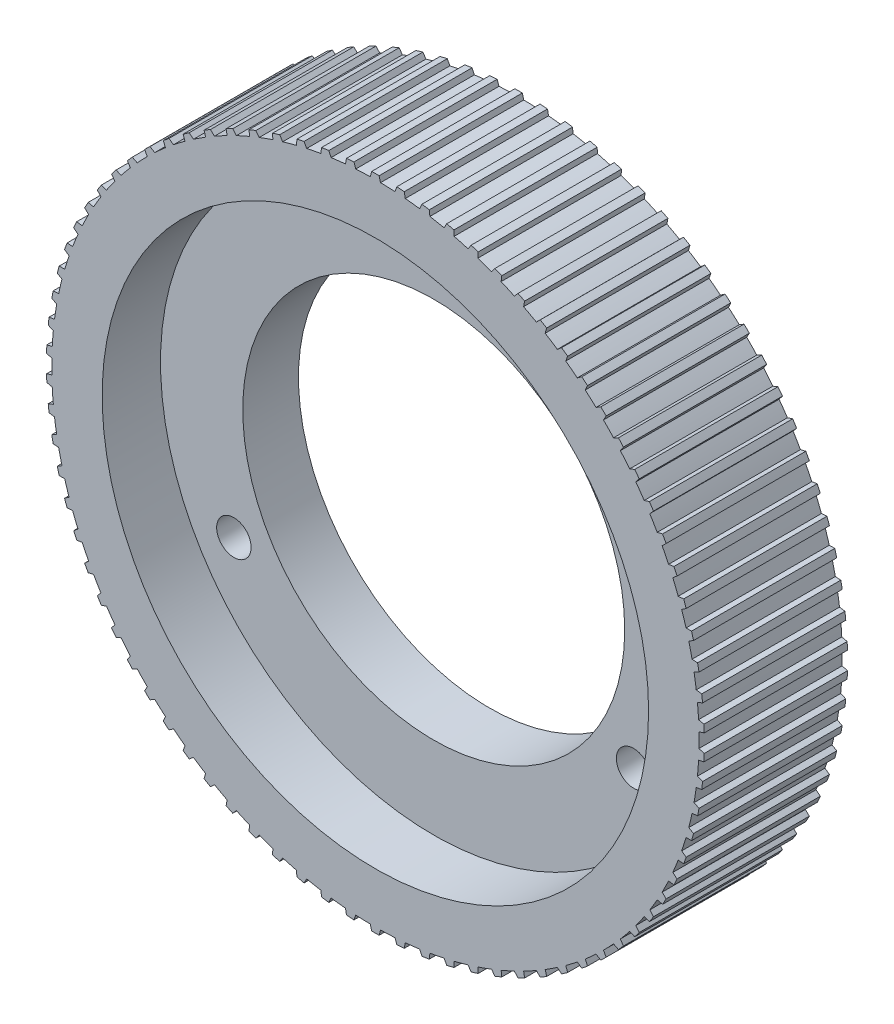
from build123d import *

# Parameters (mm, degrees)
ESQUISSE1_R                    = 61.0024145
BASE_EXTRUSION_DEPTH           = 13.5
BOSS_EXTRU_1_REACH             = 89.32
BOSS_EXTRU_1_DIRECTION_2_REACH = 89.32
R_P_TITION_CIRCULAIRE1_COUNT   = 82
ESQUISSE6_R                    = 51.5
ENL_V_MAT_EXTRU_1_DEPTH        = 11
ENL_V_MAT_EXTRU_2_REACH        = 91.117
ESQUISSE8_R                    = 3.25
R_P_TITION_CIRCULAIRE2_COUNT   = 3


with BuildPart() as part:
    # Esquisse1 → Base-Extrusion (new, symmetric)
    with BuildSketch(Plane.XY):
        Circle(ESQUISSE1_R)
    extrude(amount=BASE_EXTRUSION_DEPTH, both=True)

    # Boss.-Extru.1: up to this face of the body (flat: up to its plane)
    boss_extru_1_end = Plane(part.part.faces().sort_by_distance((0, 0, -13.5))[0])
    # Esquisse5 → Boss.-Extru.1 (add, up to the picked face)
    with BuildSketch(Plane.XY, mode=Mode.PRIVATE) as boss_extru_1_sk1:
        with BuildLine():
            Line((0.702080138, 61.998439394), (0.971035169, 60.994685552))
            ThreePointArc((0.971035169, 60.994685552), (0, 61.0024145), (-0.971035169, 60.994685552))
            Line((-0.971035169, 60.994685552), (-0.702080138, 61.998439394))
            ThreePointArc((-0.702080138, 61.998439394), (0, 62.0024145), (0.702080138, 61.998439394))
        make_face()
    boss_extru_1_tool1 = split(extrude(boss_extru_1_sk1.sketch, amount=-BOSS_EXTRU_1_REACH, mode=Mode.PRIVATE), bisect_by=boss_extru_1_end, keep=Keep.BOTH, mode=Mode.PRIVATE)
    boss_extru_1 = boss_extru_1_tool1.solids().sort_by(Axis((0, 61.473672, 0), (0, 0, -1)))[0]
    add(boss_extru_1)

    # Boss.-Extru.1 direction 2: up to this face of the body (flat: up to its plane)
    boss_extru_1_direction_2_end = Plane(part.part.faces().sort_by_distance((0, 0, 13.5))[0])
    # Esquisse5 → Boss.-Extru.1 direction 2 (add, up to the picked face)
    with BuildSketch(Plane.XY, mode=Mode.PRIVATE) as boss_extru_1_direction_2_sk1:
        with BuildLine():
            Line((0.702080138, 61.998439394), (0.971035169, 60.994685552))
            ThreePointArc((0.971035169, 60.994685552), (0, 61.0024145), (-0.971035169, 60.994685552))
            Line((-0.971035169, 60.994685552), (-0.702080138, 61.998439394))
            ThreePointArc((-0.702080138, 61.998439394), (0, 62.0024145), (0.702080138, 61.998439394))
        make_face()
    boss_extru_1_direction_2_tool1 = split(extrude(boss_extru_1_direction_2_sk1.sketch, amount=BOSS_EXTRU_1_DIRECTION_2_REACH, mode=Mode.PRIVATE), bisect_by=boss_extru_1_direction_2_end, keep=Keep.BOTH, mode=Mode.PRIVATE)
    boss_extru_1_direction_2 = boss_extru_1_direction_2_tool1.solids().sort_by(Axis((0, 61.473672, 0), (0, 0, 1)))[0]
    add(boss_extru_1_direction_2)

    # R_p_tition circulaire1: Boss.-Extru.1, Boss.-Extru.1 direction 2 ×82 about axis
    r_p_tition_circulaire1_axis = Axis((0, 0, 0), (0, 0, 1))
    add([boss_extru_1.rotate(r_p_tition_circulaire1_axis, i * 360 / R_P_TITION_CIRCULAIRE1_COUNT) for i in range(1, R_P_TITION_CIRCULAIRE1_COUNT)])
    add([boss_extru_1_direction_2.rotate(r_p_tition_circulaire1_axis, i * 360 / R_P_TITION_CIRCULAIRE1_COUNT) for i in range(1, R_P_TITION_CIRCULAIRE1_COUNT)])

    # Esquisse6 → Enl_v. mat.-Extru.1 (cut)
    with BuildSketch(Plane.XY.offset(13.5)):
        Circle(ESQUISSE6_R)
    extrude(amount=-ENL_V_MAT_EXTRU_1_DEPTH, mode=Mode.SUBTRACT)

    # Esquisse7 → Enl_vement de mati_re-R_volution1 (revolve, cut)
    with BuildSketch(Plane(origin=(0, 0, 0), x_dir=(1, 0, 0), z_dir=(0, 1, 0)), mode=Mode.PRIVATE) as enl_vement_de_mati_re_r_volution1_sk:
        Polygon((-49.25, 17.118717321), (-49.25, 10.5), (-48, 10.5), (-48, 8), (-36, 8), (-36, -19.543570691), (0, -19.543570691), (0, 17.118717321), align=None)
    revolve(enl_vement_de_mati_re_r_volution1_sk.sketch.rotate(Axis((0, 0, 44.324778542), (0, 0, -1)), 180), axis=Axis((0, 0, 44.324778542), (0, 0, -1)), mode=Mode.SUBTRACT)

    # Esquisse8 → Enl_v. mat.-Extru.2 (cut, up to next)
    with BuildSketch(Plane.XY.offset(2.5), mode=Mode.PRIVATE) as enl_v_mat_extru_2_sk1:
        with Locations((0, 43.5)):
            Circle(ESQUISSE8_R)
    enl_v_mat_extru_2_tool1 = extrude(enl_v_mat_extru_2_sk1.sketch, amount=-ENL_V_MAT_EXTRU_2_REACH, mode=Mode.PRIVATE) & part.part
    enl_v_mat_extru_2 = enl_v_mat_extru_2_tool1.solids().sort_by_distance((0, 43.5, 2.5))[0]
    add(enl_v_mat_extru_2, mode=Mode.SUBTRACT)

    # R_p_tition circulaire2: Enl_v. mat.-Extru.2 ×3 about axis
    r_p_tition_circulaire2_axis = Axis((0, 0, 0), (0, 0, 1))
    for i in range(1, R_P_TITION_CIRCULAIRE2_COUNT):
        add(enl_v_mat_extru_2.rotate(r_p_tition_circulaire2_axis, i * 360 / R_P_TITION_CIRCULAIRE2_COUNT), mode=Mode.SUBTRACT)


solid = part.part
